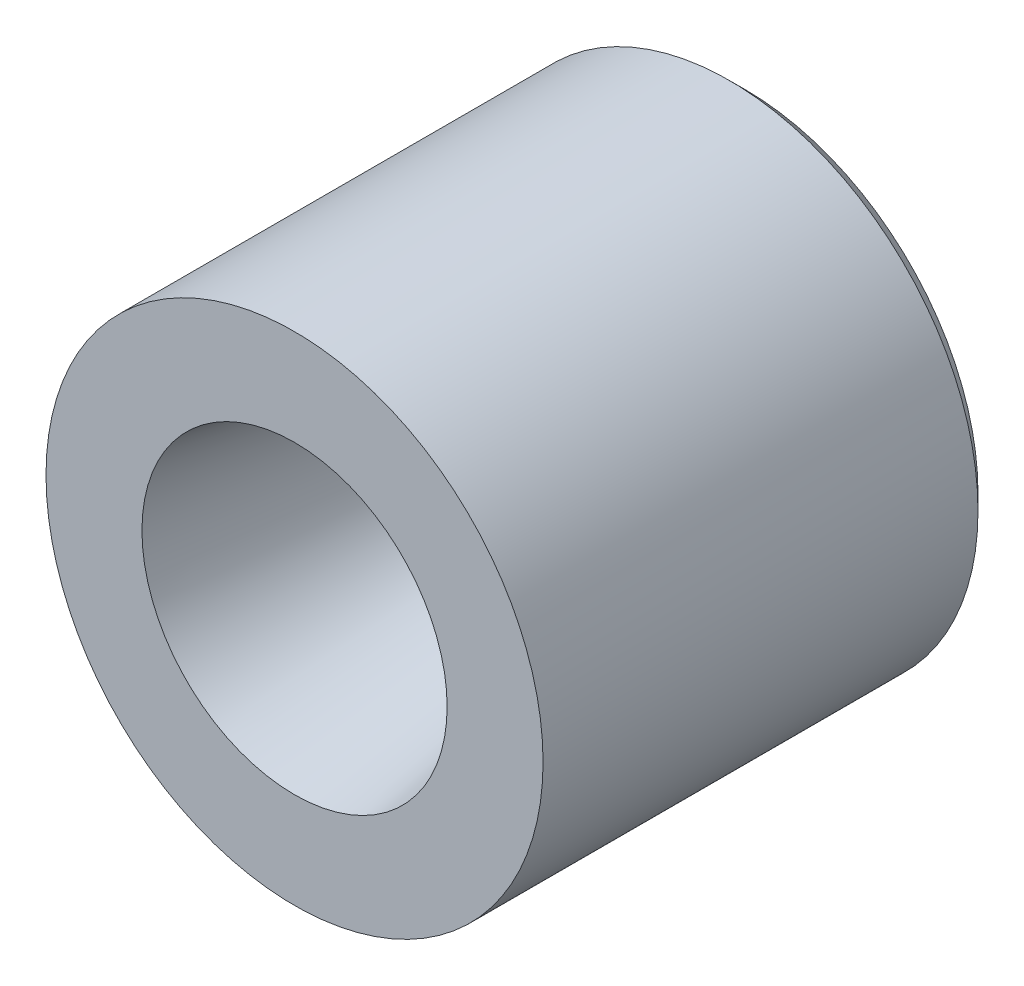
ISO-10303-21;
HEADER;
FILE_DESCRIPTION(('STEP AP214'),'2;1');
FILE_NAME('part.step','',(''),(''),'','','');
FILE_SCHEMA(('AUTOMOTIVE_DESIGN { 1 0 10303 214 1 1 1 1 }'));
ENDSEC;
DATA;
#1=APPLICATION_CONTEXT('core data for automotive mechanical design processes');
#2=APPLICATION_PROTOCOL_DEFINITION('international standard','automotive_design',2000,#1);
#3=PRODUCT_CONTEXT('',#1,'mechanical');
#4=PRODUCT('Part','Part','',(#3));
#5=PRODUCT_RELATED_PRODUCT_CATEGORY('part','',(#4));
#6=PRODUCT_DEFINITION_FORMATION('','',#4);
#7=PRODUCT_DEFINITION_CONTEXT('part definition',#1,'design');
#8=PRODUCT_DEFINITION('design','',#6,#7);
#9=PRODUCT_DEFINITION_SHAPE('','',#8);
#10=(LENGTH_UNIT() NAMED_UNIT(*) SI_UNIT(.MILLI.,.METRE.));
#11=(NAMED_UNIT(*) PLANE_ANGLE_UNIT() SI_UNIT($,.RADIAN.));
#12=(NAMED_UNIT(*) SI_UNIT($,.STERADIAN.) SOLID_ANGLE_UNIT());
#13=UNCERTAINTY_MEASURE_WITH_UNIT(LENGTH_MEASURE(1.E-05),#10,'distance_accuracy_value','');
#14=(GEOMETRIC_REPRESENTATION_CONTEXT(3) GLOBAL_UNCERTAINTY_ASSIGNED_CONTEXT((#13)) GLOBAL_UNIT_ASSIGNED_CONTEXT((#10,
#11,#12)) REPRESENTATION_CONTEXT('',''));
#15=CARTESIAN_POINT('',(0.,0.,0.));
#16=DIRECTION('',(0.,0.,1.));
#17=DIRECTION('',(1.,0.,0.));
#18=AXIS2_PLACEMENT_3D('',#15,#16,#17);
#19=CARTESIAN_POINT('',(0.,0.,-13.9534197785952));
#20=DIRECTION('',(0.,0.,1.));
#21=DIRECTION('',(1.,0.,0.));
#22=AXIS2_PLACEMENT_3D('',#19,#20,#21);
#23=CONICAL_SURFACE('',#22,10.4016755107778,0.785398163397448);
#24=CARTESIAN_POINT('',(-1.25693328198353E-13,0.,-18.));
#25=DIRECTION('',(0.,0.,1.));
#26=DIRECTION('',(-1.,0.,0.));
#27=AXIS2_PLACEMENT_3D('',#24,#25,#26);
#28=CIRCLE('',#27,6.35509528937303);
#29=CARTESIAN_POINT('',(6.3550952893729,0.,-18.));
#30=VERTEX_POINT('',#29);
#31=CARTESIAN_POINT('',(-6.35509528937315,0.,-18.));
#32=VERTEX_POINT('',#31);
#33=EDGE_CURVE('E143',#30,#32,#28,.T.);
#34=ORIENTED_EDGE('',*,*,#33,.F.);
#35=CARTESIAN_POINT('',(6.3550970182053,0.,-17.9999982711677));
#36=CARTESIAN_POINT('',(7.35509327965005,0.,-17.0000020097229));
#37=B_SPLINE_CURVE_WITH_KNOTS('',1,(#35,#36),.UNSPECIFIED.,.F.,.F.,(2,2),(0.610968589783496,
0.707106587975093),.UNSPECIFIED.);
#38=CARTESIAN_POINT('',(7.35509528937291,0.,-17.));
#39=VERTEX_POINT('',#38);
#40=EDGE_CURVE('E44',#30,#39,#37,.T.);
#41=ORIENTED_EDGE('',*,*,#40,.T.);
#42=CARTESIAN_POINT('',(-1.18710365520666E-13,0.,-17.));
#43=DIRECTION('',(0.,0.,-1.));
#44=DIRECTION('',(-1.,0.,0.));
#45=AXIS2_PLACEMENT_3D('',#42,#43,#44);
#46=CIRCLE('',#45,7.35509528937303);
#47=CARTESIAN_POINT('',(-7.35509528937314,0.,-17.));
#48=VERTEX_POINT('',#47);
#49=EDGE_CURVE('E11',#48,#39,#46,.T.);
#50=ORIENTED_EDGE('',*,*,#49,.F.);
#51=CARTESIAN_POINT('',(-1.18710365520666E-13,0.,-17.));
#52=DIRECTION('',(0.,0.,-1.));
#53=DIRECTION('',(-1.,0.,0.));
#54=AXIS2_PLACEMENT_3D('',#51,#52,#53);
#55=CIRCLE('',#54,7.35509528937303);
#56=EDGE_CURVE('E51',#39,#48,#55,.T.);
#57=ORIENTED_EDGE('',*,*,#56,.F.);
#58=ORIENTED_EDGE('',*,*,#40,.F.);
#59=CARTESIAN_POINT('',(-1.25693328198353E-13,0.,-18.));
#60=DIRECTION('',(0.,0.,1.));
#61=DIRECTION('',(-1.,0.,0.));
#62=AXIS2_PLACEMENT_3D('',#59,#60,#61);
#63=CIRCLE('',#62,6.35509528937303);
#64=EDGE_CURVE('E59',#32,#30,#63,.T.);
#65=ORIENTED_EDGE('',*,*,#64,.F.);
#66=EDGE_LOOP('',(#34,#41,#50,#57,#58,#65));
#67=FACE_BOUND('',#66,.T.);
#68=ADVANCED_FACE('F36',(#67),#23,.F.);
#69=CARTESIAN_POINT('',(-1.15218884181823E-13,0.,-16.5));
#70=DIRECTION('',(0.,0.,-1.));
#71=DIRECTION('',(-1.,0.,0.));
#72=AXIS2_PLACEMENT_3D('',#69,#70,#71);
#73=CYLINDRICAL_SURFACE('',#72,7.35509528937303);
#74=CARTESIAN_POINT('',(-1.04744440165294E-13,0.,-15.));
#75=DIRECTION('',(0.,0.,-1.));
#76=DIRECTION('',(-1.,0.,0.));
#77=AXIS2_PLACEMENT_3D('',#74,#75,#76);
#78=CIRCLE('',#77,7.35509528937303);
#79=CARTESIAN_POINT('',(-7.35509528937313,0.,-15.));
#80=VERTEX_POINT('',#79);
#81=EDGE_CURVE('E152',#80,#80,#78,.T.);
#82=ORIENTED_EDGE('',*,*,#81,.F.);
#83=CARTESIAN_POINT('',(-7.35509528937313,0.,-14.9999969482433));
#84=CARTESIAN_POINT('',(-7.35509528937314,0.,-17.0000020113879));
#85=B_SPLINE_CURVE_WITH_KNOTS('',1,(#83,#84),.UNSPECIFIED.,.F.,.F.,(2,2),(0.0833320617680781,
0.91666750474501),.UNSPECIFIED.);
#86=EDGE_CURVE('E147',#80,#48,#85,.T.);
#87=ORIENTED_EDGE('',*,*,#86,.T.);
#88=ORIENTED_EDGE('',*,*,#49,.T.);
#89=ORIENTED_EDGE('',*,*,#56,.T.);
#90=ORIENTED_EDGE('',*,*,#86,.F.);
#91=EDGE_LOOP('',(#82,#87,#88,#89,#90));
#92=FACE_BOUND('',#91,.T.);
#93=ADVANCED_FACE('F191',(#92),#73,.F.);
#94=CARTESIAN_POINT('',(14.6167191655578,-13.2088175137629,-18.));
#95=DIRECTION('',(0.,0.,-1.));
#96=DIRECTION('',(-1.,0.,0.));
#97=AXIS2_PLACEMENT_3D('',#94,#95,#96);
#98=PLANE('',#97);
#99=CARTESIAN_POINT('',(-2.09488880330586E-13,0.,-17.9999999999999));
#100=DIRECTION('',(0.,0.,-1.));
#101=DIRECTION('',(-1.,0.,0.));
#102=AXIS2_PLACEMENT_3D('',#99,#100,#101);
#103=CIRCLE('',#102,4.24999999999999);
#104=CARTESIAN_POINT('',(-4.2500000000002,0.,-17.9999999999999));
#105=VERTEX_POINT('',#104);
#106=EDGE_CURVE('E103',#105,#105,#103,.T.);
#107=ORIENTED_EDGE('',*,*,#106,.T.);
#108=EDGE_LOOP('',(#107));
#109=FACE_BOUND('',#108,.T.);
#110=ORIENTED_EDGE('',*,*,#64,.T.);
#111=ORIENTED_EDGE('',*,*,#33,.T.);
#112=EDGE_LOOP('',(#110,#111));
#113=FACE_BOUND('',#112,.T.);
#114=ADVANCED_FACE('F193',(#109,#113),#98,.F.);
#115=CARTESIAN_POINT('',(0.,0.,-1.));
#116=DIRECTION('',(0.,0.,1.));
#117=DIRECTION('',(-1.,0.,0.));
#118=AXIS2_PLACEMENT_3D('',#115,#116,#117);
#119=CONICAL_SURFACE('',#118,9.82367301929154,0.174532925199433);
#120=ORIENTED_EDGE('',*,*,#81,.T.);
#121=CARTESIAN_POINT('',(-7.35509528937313,0.,-15.));
#122=CARTESIAN_POINT('',(-9.82367301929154,0.,-0.999999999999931));
#123=B_SPLINE_CURVE_WITH_KNOTS('',1,(#121,#122),.UNSPECIFIED.,.F.,.F.,(2,2),(0.,1.),.UNSPECIFIED.);
#124=CARTESIAN_POINT('',(-9.82367301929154,0.,-0.999999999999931));
#125=VERTEX_POINT('',#124);
#126=EDGE_CURVE('E108',#80,#125,#123,.T.);
#127=ORIENTED_EDGE('',*,*,#126,.T.);
#128=CARTESIAN_POINT('',(0.,0.,-1.));
#129=DIRECTION('',(0.,0.,-1.));
#130=DIRECTION('',(1.,0.,0.));
#131=AXIS2_PLACEMENT_3D('',#128,#129,#130);
#132=CIRCLE('',#131,9.82367301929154);
#133=CARTESIAN_POINT('',(9.82367301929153,0.,-1.00000000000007));
#134=VERTEX_POINT('',#133);
#135=EDGE_CURVE('E133',#134,#125,#132,.T.);
#136=ORIENTED_EDGE('',*,*,#135,.F.);
#137=CARTESIAN_POINT('',(0.,0.,-1.));
#138=DIRECTION('',(0.,0.,-1.));
#139=DIRECTION('',(1.,0.,0.));
#140=AXIS2_PLACEMENT_3D('',#137,#138,#139);
#141=CIRCLE('',#140,9.82367301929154);
#142=EDGE_CURVE('E126',#125,#134,#141,.T.);
#143=ORIENTED_EDGE('',*,*,#142,.F.);
#144=ORIENTED_EDGE('',*,*,#126,.F.);
#145=EDGE_LOOP('',(#120,#127,#136,#143,#144));
#146=FACE_BOUND('',#145,.T.);
#147=ADVANCED_FACE('F189',(#146),#119,.F.);
#148=CARTESIAN_POINT('',(-1.56226912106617E-13,0.,-22.3725830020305));
#149=DIRECTION('',(0.,0.,1.));
#150=DIRECTION('',(1.,0.,0.));
#151=AXIS2_PLACEMENT_3D('',#148,#149,#150);
#152=CONICAL_SURFACE('',#151,22.6274169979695,0.785398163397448);
#153=CARTESIAN_POINT('',(-2.09488880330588E-13,0.,-30.));
#154=DIRECTION('',(0.,0.,1.));
#155=DIRECTION('',(-1.,0.,0.));
#156=AXIS2_PLACEMENT_3D('',#153,#154,#155);
#157=CIRCLE('',#156,15.);
#158=CARTESIAN_POINT('',(-15.,0.,-30.));
#159=VERTEX_POINT('',#158);
#160=CARTESIAN_POINT('',(14.9999999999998,0.,-30.));
#161=VERTEX_POINT('',#160);
#162=EDGE_CURVE('E90',#159,#161,#157,.T.);
#163=ORIENTED_EDGE('',*,*,#162,.T.);
#164=CARTESIAN_POINT('',(15.0000010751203,0.,-29.9999989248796));
#165=CARTESIAN_POINT('',(16.0000024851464,0.,-28.9999975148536));
#166=B_SPLINE_CURVE_WITH_KNOTS('',1,(#164,#165),.UNSPECIFIED.,.F.,.F.,(2,2),(0.662912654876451,
0.707106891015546),.UNSPECIFIED.);
#167=CARTESIAN_POINT('',(16.,0.,-29.));
#168=VERTEX_POINT('',#167);
#169=EDGE_CURVE('E95',#161,#168,#166,.T.);
#170=ORIENTED_EDGE('',*,*,#169,.T.);
#171=CARTESIAN_POINT('',(-2.02505917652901E-13,0.,-29.));
#172=DIRECTION('',(0.,0.,-1.));
#173=DIRECTION('',(-1.,0.,0.));
#174=AXIS2_PLACEMENT_3D('',#171,#172,#173);
#175=CIRCLE('',#174,16.);
#176=CARTESIAN_POINT('',(-16.,0.,-29.));
#177=VERTEX_POINT('',#176);
#178=EDGE_CURVE('E102',#168,#177,#175,.T.);
#179=ORIENTED_EDGE('',*,*,#178,.T.);
#180=CARTESIAN_POINT('',(-2.02505917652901E-13,0.,-29.));
#181=DIRECTION('',(0.,0.,-1.));
#182=DIRECTION('',(-1.,0.,0.));
#183=AXIS2_PLACEMENT_3D('',#180,#181,#182);
#184=CIRCLE('',#183,16.);
#185=EDGE_CURVE('E105',#177,#168,#184,.T.);
#186=ORIENTED_EDGE('',*,*,#185,.T.);
#187=ORIENTED_EDGE('',*,*,#169,.F.);
#188=CARTESIAN_POINT('',(-2.09488880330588E-13,0.,-30.));
#189=DIRECTION('',(0.,0.,1.));
#190=DIRECTION('',(-1.,0.,0.));
#191=AXIS2_PLACEMENT_3D('',#188,#189,#190);
#192=CIRCLE('',#191,15.);
#193=EDGE_CURVE('E97',#161,#159,#192,.T.);
#194=ORIENTED_EDGE('',*,*,#193,.T.);
#195=EDGE_LOOP('',(#163,#170,#179,#186,#187,#194));
#196=FACE_BOUND('',#195,.T.);
#197=ADVANCED_FACE('F92',(#196),#152,.T.);
#198=CARTESIAN_POINT('',(-1.08235921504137E-13,0.,-15.5));
#199=DIRECTION('',(0.,0.,-1.));
#200=DIRECTION('',(-1.,0.,0.));
#201=AXIS2_PLACEMENT_3D('',#198,#199,#200);
#202=CYLINDRICAL_SURFACE('',#201,16.);
#203=CARTESIAN_POINT('',(0.,0.,-1.));
#204=DIRECTION('',(0.,0.,1.));
#205=DIRECTION('',(-1.,0.,0.));
#206=AXIS2_PLACEMENT_3D('',#203,#204,#205);
#207=CIRCLE('',#206,16.);
#208=CARTESIAN_POINT('',(-16.,0.,-0.999999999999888));
#209=VERTEX_POINT('',#208);
#210=EDGE_CURVE('E99',#209,#209,#207,.T.);
#211=ORIENTED_EDGE('',*,*,#210,.F.);
#212=CARTESIAN_POINT('',(-16.,0.,-0.999998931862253));
#213=CARTESIAN_POINT('',(-16.,0.,-28.9999996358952));
#214=B_SPLINE_CURVE_WITH_KNOTS('',1,(#212,#213),.UNSPECIFIED.,.F.,.F.,(2,2),(0.0833333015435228,
0.916666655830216),.UNSPECIFIED.);
#215=EDGE_CURVE('E173',#209,#177,#214,.T.);
#216=ORIENTED_EDGE('',*,*,#215,.T.);
#217=ORIENTED_EDGE('',*,*,#178,.F.);
#218=ORIENTED_EDGE('',*,*,#185,.F.);
#219=ORIENTED_EDGE('',*,*,#215,.F.);
#220=EDGE_LOOP('',(#211,#216,#217,#218,#219));
#221=FACE_BOUND('',#220,.T.);
#222=ADVANCED_FACE('F225',(#221),#202,.T.);
#223=CARTESIAN_POINT('',(34.5,-31.1769145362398,-30.));
#224=DIRECTION('',(0.,0.,-1.));
#225=DIRECTION('',(-1.,0.,0.));
#226=AXIS2_PLACEMENT_3D('',#223,#224,#225);
#227=PLANE('',#226);
#228=CARTESIAN_POINT('',(-2.09488880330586E-13,0.,-29.9999999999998));
#229=DIRECTION('',(0.,0.,-1.));
#230=DIRECTION('',(-1.,0.,0.));
#231=AXIS2_PLACEMENT_3D('',#228,#229,#230);
#232=CIRCLE('',#231,4.24999999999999);
#233=CARTESIAN_POINT('',(-4.2500000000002,0.,-29.9999999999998));
#234=VERTEX_POINT('',#233);
#235=EDGE_CURVE('E275',#234,#234,#232,.T.);
#236=ORIENTED_EDGE('',*,*,#235,.F.);
#237=EDGE_LOOP('',(#236));
#238=FACE_BOUND('',#237,.T.);
#239=ORIENTED_EDGE('',*,*,#193,.F.);
#240=ORIENTED_EDGE('',*,*,#162,.F.);
#241=EDGE_LOOP('',(#239,#240));
#242=FACE_BOUND('',#241,.T.);
#243=ADVANCED_FACE('F101',(#238,#242),#227,.T.);
#244=CARTESIAN_POINT('',(-20.8,-33.2553755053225,-0.999999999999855));
#245=DIRECTION('',(0.,0.,1.));
#246=DIRECTION('',(1.,0.,0.));
#247=AXIS2_PLACEMENT_3D('',#244,#245,#246);
#248=PLANE('',#247);
#249=ORIENTED_EDGE('',*,*,#210,.T.);
#250=EDGE_LOOP('',(#249));
#251=FACE_BOUND('',#250,.T.);
#252=ORIENTED_EDGE('',*,*,#135,.T.);
#253=ORIENTED_EDGE('',*,*,#142,.T.);
#254=EDGE_LOOP('',(#252,#253));
#255=FACE_BOUND('',#254,.T.);
#256=ADVANCED_FACE('F240',(#251,#255),#248,.T.);
#257=CARTESIAN_POINT('',(-2.09488880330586E-13,0.,-29.9999999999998));
#258=DIRECTION('',(0.,0.,-1.));
#259=DIRECTION('',(-1.,0.,0.));
#260=AXIS2_PLACEMENT_3D('',#257,#258,#259);
#261=CYLINDRICAL_SURFACE('',#260,4.24999999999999);
#262=ORIENTED_EDGE('',*,*,#235,.T.);
#263=EDGE_LOOP('',(#262));
#264=FACE_BOUND('',#263,.T.);
#265=ORIENTED_EDGE('',*,*,#106,.F.);
#266=EDGE_LOOP('',(#265));
#267=FACE_BOUND('',#266,.T.);
#268=ADVANCED_FACE('F248',(#264,#267),#261,.F.);
#269=CLOSED_SHELL('',(#68,#93,#114,#147,#197,#222,#243,#256,#268));
#270=MANIFOLD_SOLID_BREP('B2',#269);
#271=ADVANCED_BREP_SHAPE_REPRESENTATION('',(#18,#270),#14);
#272=SHAPE_DEFINITION_REPRESENTATION(#9,#271);
ENDSEC;
END-ISO-10303-21;
